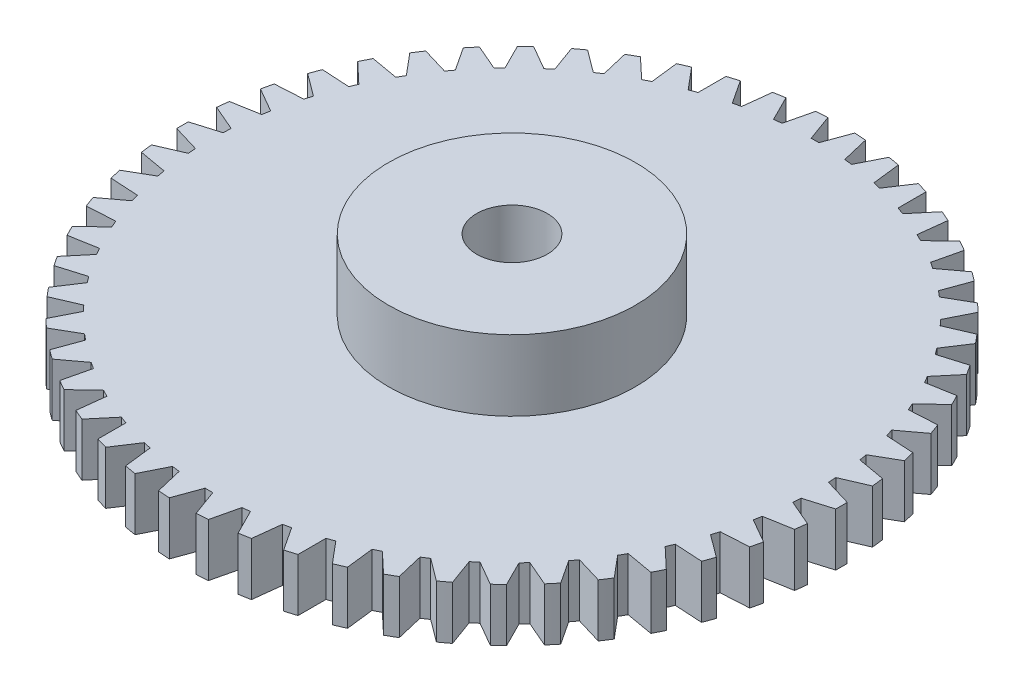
from build123d import *

# Parameters (mm, degrees)
SKETCH1_R         = 29.6291
EXTRUDE1_DEPTH    = 4.7625
EXTRUDE2_DEPTH    = 43.171655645
CIRPATTERN1_COUNT = 54
SKETCH3_R         = 11.1125
EXTRUDE3_DEPTH    = 6.35
SKETCH4_R         = 3.175
EXTRUDE4_DEPTH    = 44.333612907


with BuildPart() as part:
    # Sketch1 → Extrude1 (new body)
    with BuildSketch(Plane(origin=(0, 0, 0), x_dir=(1, 0, 0), z_dir=(0, 1, 0))):
        with Locations(Location((0, 0, 0), (0, 0, 270))):
            Circle(SKETCH1_R)
    extrude(amount=-EXTRUDE1_DEPTH)

    # Sketch2 → Extrude2 (cut, symmetric)
    with BuildSketch(Plane(origin=(0, 0, 0), x_dir=(1, 0, 0), z_dir=(0, 1, 0))):
        Polygon((-50.304808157, 164.504324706), (-1.205314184, 29.60457371), (-0.347074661, 27.24658), (0.347074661, 27.24658), (1.205314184, 29.60457371), (50.304808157, 164.504324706), (50.304808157, 451.618957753), (-50.304808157, 451.618957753), align=None)
    extrude2 = extrude(amount=EXTRUDE2_DEPTH, both=True, mode=Mode.SUBTRACT)

    # CirPattern1: Extrude2 ×54 about axis
    cirpattern1_axis = Axis((0, -50.272992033, 0), (0, 1, 0))
    for i in range(1, CIRPATTERN1_COUNT):
        add(extrude2.rotate(cirpattern1_axis, i * 360 / CIRPATTERN1_COUNT), mode=Mode.SUBTRACT)

    # Sketch3 → Extrude3 (add)
    with BuildSketch(Plane(origin=(0, 0, 0), x_dir=(1, 0, 0), z_dir=(0, 1, 0))):
        with Locations(Location((0, 0, 0), (0, 0, 270))):
            Circle(SKETCH3_R)
    extrude(amount=EXTRUDE3_DEPTH)

    # Sketch4 → Extrude4 (cut, through all)
    with BuildSketch(Plane(origin=(0, 6.35, 0), x_dir=(1, 0, 0), z_dir=(0, 1, 0))):
        with Locations(Location((0, 0, 0), (0, 0, 270))):
            Circle(SKETCH4_R)
    extrude(amount=-EXTRUDE4_DEPTH, mode=Mode.SUBTRACT)


solid = part.part
